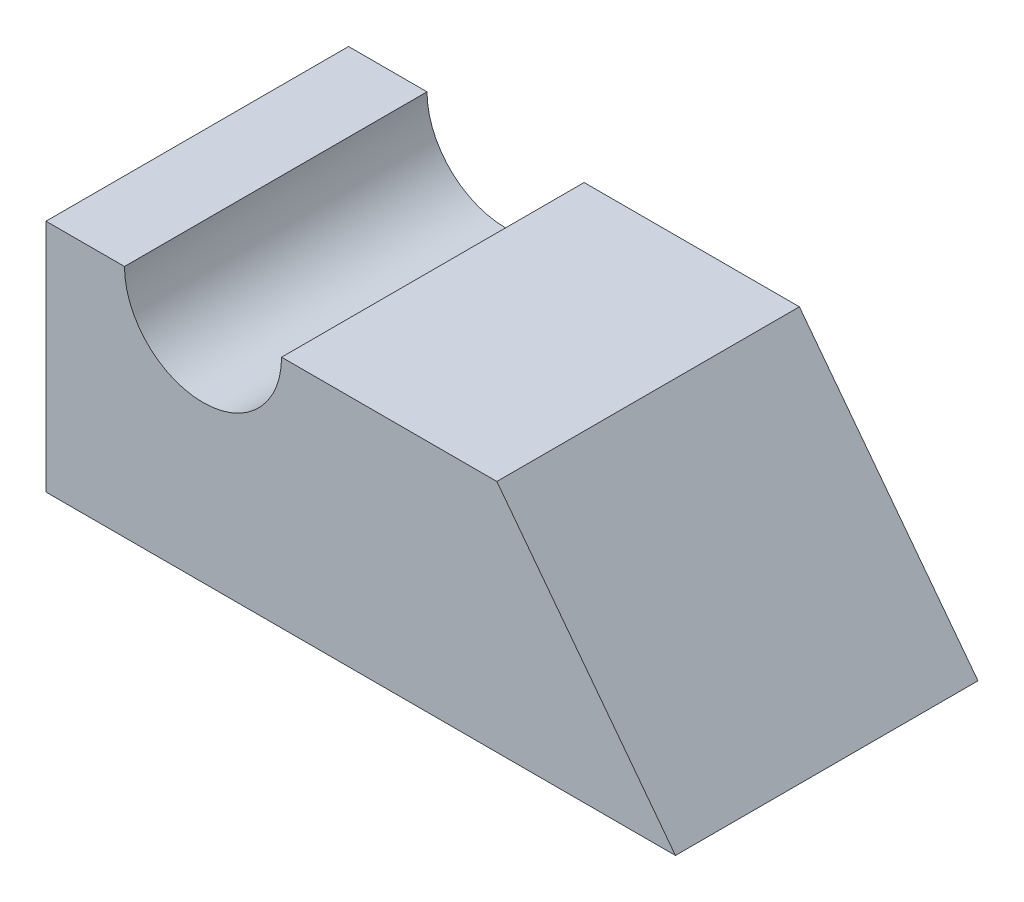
ISO-10303-21;
HEADER;
FILE_DESCRIPTION(('STEP AP214'),'2;1');
FILE_NAME('part.step','',(''),(''),'','','');
FILE_SCHEMA(('AUTOMOTIVE_DESIGN { 1 0 10303 214 1 1 1 1 }'));
ENDSEC;
DATA;
#1=APPLICATION_CONTEXT('core data for automotive mechanical design processes');
#2=APPLICATION_PROTOCOL_DEFINITION('international standard','automotive_design',2000,#1);
#3=PRODUCT_CONTEXT('',#1,'mechanical');
#4=PRODUCT('Part','Part','',(#3));
#5=PRODUCT_RELATED_PRODUCT_CATEGORY('part','',(#4));
#6=PRODUCT_DEFINITION_FORMATION('','',#4);
#7=PRODUCT_DEFINITION_CONTEXT('part definition',#1,'design');
#8=PRODUCT_DEFINITION('design','',#6,#7);
#9=PRODUCT_DEFINITION_SHAPE('','',#8);
#10=(LENGTH_UNIT() NAMED_UNIT(*) SI_UNIT(.MILLI.,.METRE.));
#11=(NAMED_UNIT(*) PLANE_ANGLE_UNIT() SI_UNIT($,.RADIAN.));
#12=(NAMED_UNIT(*) SI_UNIT($,.STERADIAN.) SOLID_ANGLE_UNIT());
#13=UNCERTAINTY_MEASURE_WITH_UNIT(LENGTH_MEASURE(1.E-05),#10,'distance_accuracy_value','');
#14=(GEOMETRIC_REPRESENTATION_CONTEXT(3) GLOBAL_UNCERTAINTY_ASSIGNED_CONTEXT((#13)) GLOBAL_UNIT_ASSIGNED_CONTEXT((#10,
#11,#12)) REPRESENTATION_CONTEXT('',''));
#15=CARTESIAN_POINT('',(0.,0.,0.));
#16=DIRECTION('',(0.,0.,1.));
#17=DIRECTION('',(1.,0.,0.));
#18=AXIS2_PLACEMENT_3D('',#15,#16,#17);
#19=CARTESIAN_POINT('',(0.,35.4548164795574,22.86));
#20=DIRECTION('',(1.,0.,0.));
#21=DIRECTION('',(0.,0.,-1.));
#22=AXIS2_PLACEMENT_3D('',#19,#20,#21);
#23=PLANE('',#22);
#24=DIRECTION('',(0.,-1.,0.));
#25=VECTOR('',#24,1.);
#26=CARTESIAN_POINT('',(0.,35.4548164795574,-22.86));
#27=LINE('',#26,#25);
#28=CARTESIAN_POINT('',(0.,35.4548164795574,-22.86));
#29=VERTEX_POINT('',#28);
#30=CARTESIAN_POINT('',(0.,0.,-22.86));
#31=VERTEX_POINT('',#30);
#32=EDGE_CURVE('E117',#29,#31,#27,.T.);
#33=ORIENTED_EDGE('',*,*,#32,.T.);
#34=DIRECTION('',(0.,0.,-1.));
#35=VECTOR('',#34,1.);
#36=CARTESIAN_POINT('',(0.,0.,22.86));
#37=LINE('',#36,#35);
#38=CARTESIAN_POINT('',(0.,0.,22.86));
#39=VERTEX_POINT('',#38);
#40=EDGE_CURVE('E11',#39,#31,#37,.T.);
#41=ORIENTED_EDGE('',*,*,#40,.F.);
#42=DIRECTION('',(0.,-1.,0.));
#43=VECTOR('',#42,1.);
#44=CARTESIAN_POINT('',(0.,35.4548164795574,22.86));
#45=LINE('',#44,#43);
#46=CARTESIAN_POINT('',(0.,35.4548164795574,22.86));
#47=VERTEX_POINT('',#46);
#48=EDGE_CURVE('E127',#47,#39,#45,.T.);
#49=ORIENTED_EDGE('',*,*,#48,.F.);
#50=DIRECTION('',(0.,0.,-1.));
#51=VECTOR('',#50,1.);
#52=CARTESIAN_POINT('',(0.,35.4548164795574,22.86));
#53=LINE('',#52,#51);
#54=EDGE_CURVE('E113',#47,#29,#53,.T.);
#55=ORIENTED_EDGE('',*,*,#54,.T.);
#56=EDGE_LOOP('',(#33,#41,#49,#55));
#57=FACE_BOUND('',#56,.T.);
#58=ADVANCED_FACE('F33',(#57),#23,.F.);
#59=CARTESIAN_POINT('',(0.,0.,22.86));
#60=DIRECTION('',(0.,1.,0.));
#61=DIRECTION('',(0.,0.,1.));
#62=AXIS2_PLACEMENT_3D('',#59,#60,#61);
#63=PLANE('',#62);
#64=DIRECTION('',(1.,0.,0.));
#65=VECTOR('',#64,1.);
#66=CARTESIAN_POINT('',(0.,0.,-22.86));
#67=LINE('',#66,#65);
#68=CARTESIAN_POINT('',(95.1234671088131,0.,-22.86));
#69=VERTEX_POINT('',#68);
#70=EDGE_CURVE('E120',#31,#69,#67,.T.);
#71=ORIENTED_EDGE('',*,*,#70,.T.);
#72=DIRECTION('',(0.,0.,-1.));
#73=VECTOR('',#72,1.);
#74=CARTESIAN_POINT('',(95.1234671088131,0.,22.86));
#75=LINE('',#74,#73);
#76=CARTESIAN_POINT('',(95.1234671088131,0.,22.86));
#77=VERTEX_POINT('',#76);
#78=EDGE_CURVE('E41',#77,#69,#75,.T.);
#79=ORIENTED_EDGE('',*,*,#78,.F.);
#80=DIRECTION('',(1.,0.,0.));
#81=VECTOR('',#80,1.);
#82=CARTESIAN_POINT('',(0.,0.,22.86));
#83=LINE('',#82,#81);
#84=EDGE_CURVE('E86',#39,#77,#83,.T.);
#85=ORIENTED_EDGE('',*,*,#84,.F.);
#86=ORIENTED_EDGE('',*,*,#40,.T.);
#87=EDGE_LOOP('',(#71,#79,#85,#86));
#88=FACE_BOUND('',#87,.T.);
#89=ADVANCED_FACE('F151',(#88),#63,.F.);
#90=CARTESIAN_POINT('',(95.1234671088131,0.,22.86));
#91=DIRECTION('',(-0.795658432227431,-0.605745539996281,0.));
#92=DIRECTION('',(0.605745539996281,-0.795658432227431,0.));
#93=AXIS2_PLACEMENT_3D('',#90,#91,#92);
#94=PLANE('',#93);
#95=DIRECTION('',(-0.605745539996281,0.795658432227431,0.));
#96=VECTOR('',#95,1.);
#97=CARTESIAN_POINT('',(95.1234671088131,0.,-22.86));
#98=LINE('',#97,#96);
#99=CARTESIAN_POINT('',(68.1312351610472,35.4548164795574,-22.86));
#100=VERTEX_POINT('',#99);
#101=EDGE_CURVE('E122',#69,#100,#98,.T.);
#102=ORIENTED_EDGE('',*,*,#101,.T.);
#103=DIRECTION('',(0.,0.,-1.));
#104=VECTOR('',#103,1.);
#105=CARTESIAN_POINT('',(68.1312351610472,35.4548164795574,22.86));
#106=LINE('',#105,#104);
#107=CARTESIAN_POINT('',(68.1312351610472,35.4548164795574,22.86));
#108=VERTEX_POINT('',#107);
#109=EDGE_CURVE('E108',#108,#100,#106,.T.);
#110=ORIENTED_EDGE('',*,*,#109,.F.);
#111=DIRECTION('',(-0.605745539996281,0.795658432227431,0.));
#112=VECTOR('',#111,1.);
#113=CARTESIAN_POINT('',(95.1234671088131,0.,22.86));
#114=LINE('',#113,#112);
#115=EDGE_CURVE('E99',#77,#108,#114,.T.);
#116=ORIENTED_EDGE('',*,*,#115,.F.);
#117=ORIENTED_EDGE('',*,*,#78,.T.);
#118=EDGE_LOOP('',(#102,#110,#116,#117));
#119=FACE_BOUND('',#118,.T.);
#120=ADVANCED_FACE('F133',(#119),#94,.F.);
#121=CARTESIAN_POINT('',(68.1312351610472,35.4548164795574,22.86));
#122=DIRECTION('',(0.,-1.,0.));
#123=DIRECTION('',(1.,0.,0.));
#124=AXIS2_PLACEMENT_3D('',#121,#122,#123);
#125=PLANE('',#124);
#126=DIRECTION('',(-1.,0.,0.));
#127=VECTOR('',#126,1.);
#128=CARTESIAN_POINT('',(68.1312351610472,35.4548164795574,-22.86));
#129=LINE('',#128,#127);
#130=CARTESIAN_POINT('',(35.5995632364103,35.4548164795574,-22.86));
#131=VERTEX_POINT('',#130);
#132=EDGE_CURVE('E107',#100,#131,#129,.T.);
#133=ORIENTED_EDGE('',*,*,#132,.T.);
#134=DIRECTION('',(0.,0.,-1.));
#135=VECTOR('',#134,1.);
#136=CARTESIAN_POINT('',(35.5995632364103,35.4548164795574,22.86));
#137=LINE('',#136,#135);
#138=CARTESIAN_POINT('',(35.5995632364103,35.4548164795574,22.86));
#139=VERTEX_POINT('',#138);
#140=EDGE_CURVE('E104',#139,#131,#137,.T.);
#141=ORIENTED_EDGE('',*,*,#140,.F.);
#142=DIRECTION('',(-1.,0.,0.));
#143=VECTOR('',#142,1.);
#144=CARTESIAN_POINT('',(68.1312351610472,35.4548164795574,22.86));
#145=LINE('',#144,#143);
#146=EDGE_CURVE('E93',#108,#139,#145,.T.);
#147=ORIENTED_EDGE('',*,*,#146,.F.);
#148=ORIENTED_EDGE('',*,*,#109,.T.);
#149=EDGE_LOOP('',(#133,#141,#147,#148));
#150=FACE_BOUND('',#149,.T.);
#151=ADVANCED_FACE('F105',(#150),#125,.F.);
#152=CARTESIAN_POINT('',(23.7291893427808,35.4548164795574,22.86));
#153=DIRECTION('',(0.,0.,-1.));
#154=DIRECTION('',(-1.,0.,0.));
#155=AXIS2_PLACEMENT_3D('',#152,#153,#154);
#156=CYLINDRICAL_SURFACE('',#155,11.8703738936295);
#157=CARTESIAN_POINT('',(23.7291893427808,35.4548164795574,-22.86));
#158=DIRECTION('',(0.,0.,-1.));
#159=DIRECTION('',(-1.,0.,0.));
#160=AXIS2_PLACEMENT_3D('',#157,#158,#159);
#161=CIRCLE('',#160,11.8703738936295);
#162=CARTESIAN_POINT('',(11.8588154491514,35.4548164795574,-22.86));
#163=VERTEX_POINT('',#162);
#164=EDGE_CURVE('E72',#131,#163,#161,.T.);
#165=ORIENTED_EDGE('',*,*,#164,.T.);
#166=DIRECTION('',(0.,0.,-1.));
#167=VECTOR('',#166,1.);
#168=CARTESIAN_POINT('',(11.8588154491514,35.4548164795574,22.86));
#169=LINE('',#168,#167);
#170=CARTESIAN_POINT('',(11.8588154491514,35.4548164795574,22.86));
#171=VERTEX_POINT('',#170);
#172=EDGE_CURVE('E109',#171,#163,#169,.T.);
#173=ORIENTED_EDGE('',*,*,#172,.F.);
#174=CARTESIAN_POINT('',(23.7291893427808,35.4548164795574,22.86));
#175=DIRECTION('',(0.,0.,-1.));
#176=DIRECTION('',(-1.,0.,0.));
#177=AXIS2_PLACEMENT_3D('',#174,#175,#176);
#178=CIRCLE('',#177,11.8703738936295);
#179=EDGE_CURVE('E97',#139,#171,#178,.T.);
#180=ORIENTED_EDGE('',*,*,#179,.F.);
#181=ORIENTED_EDGE('',*,*,#140,.T.);
#182=EDGE_LOOP('',(#165,#173,#180,#181));
#183=FACE_BOUND('',#182,.T.);
#184=ADVANCED_FACE('F111',(#183),#156,.F.);
#185=CARTESIAN_POINT('',(11.8588154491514,35.4548164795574,22.86));
#186=DIRECTION('',(0.,-1.,0.));
#187=DIRECTION('',(1.,0.,0.));
#188=AXIS2_PLACEMENT_3D('',#185,#186,#187);
#189=PLANE('',#188);
#190=DIRECTION('',(-1.,0.,0.));
#191=VECTOR('',#190,1.);
#192=CARTESIAN_POINT('',(11.8588154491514,35.4548164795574,-22.86));
#193=LINE('',#192,#191);
#194=EDGE_CURVE('E78',#163,#29,#193,.T.);
#195=ORIENTED_EDGE('',*,*,#194,.T.);
#196=ORIENTED_EDGE('',*,*,#54,.F.);
#197=DIRECTION('',(-1.,0.,0.));
#198=VECTOR('',#197,1.);
#199=CARTESIAN_POINT('',(11.8588154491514,35.4548164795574,22.86));
#200=LINE('',#199,#198);
#201=EDGE_CURVE('E49',#171,#47,#200,.T.);
#202=ORIENTED_EDGE('',*,*,#201,.F.);
#203=ORIENTED_EDGE('',*,*,#172,.T.);
#204=EDGE_LOOP('',(#195,#196,#202,#203));
#205=FACE_BOUND('',#204,.T.);
#206=ADVANCED_FACE('F140',(#205),#189,.F.);
#207=CARTESIAN_POINT('',(23.7291893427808,35.4548164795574,22.86));
#208=DIRECTION('',(0.,0.,-1.));
#209=DIRECTION('',(-1.,0.,0.));
#210=AXIS2_PLACEMENT_3D('',#207,#208,#209);
#211=PLANE('',#210);
#212=ORIENTED_EDGE('',*,*,#48,.T.);
#213=ORIENTED_EDGE('',*,*,#84,.T.);
#214=ORIENTED_EDGE('',*,*,#115,.T.);
#215=ORIENTED_EDGE('',*,*,#146,.T.);
#216=ORIENTED_EDGE('',*,*,#179,.T.);
#217=ORIENTED_EDGE('',*,*,#201,.T.);
#218=EDGE_LOOP('',(#212,#213,#214,#215,#216,#217));
#219=FACE_BOUND('',#218,.T.);
#220=ADVANCED_FACE('F95',(#219),#211,.F.);
#221=CARTESIAN_POINT('',(23.7291893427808,35.4548164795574,-22.86));
#222=DIRECTION('',(0.,0.,-1.));
#223=DIRECTION('',(-1.,0.,0.));
#224=AXIS2_PLACEMENT_3D('',#221,#222,#223);
#225=PLANE('',#224);
#226=ORIENTED_EDGE('',*,*,#32,.F.);
#227=ORIENTED_EDGE('',*,*,#194,.F.);
#228=ORIENTED_EDGE('',*,*,#164,.F.);
#229=ORIENTED_EDGE('',*,*,#132,.F.);
#230=ORIENTED_EDGE('',*,*,#101,.F.);
#231=ORIENTED_EDGE('',*,*,#70,.F.);
#232=EDGE_LOOP('',(#226,#227,#228,#229,#230,#231));
#233=FACE_BOUND('',#232,.T.);
#234=ADVANCED_FACE('F136',(#233),#225,.T.);
#235=CLOSED_SHELL('',(#58,#89,#120,#151,#184,#206,#220,#234));
#236=MANIFOLD_SOLID_BREP('B2',#235);
#237=ADVANCED_BREP_SHAPE_REPRESENTATION('',(#18,#236),#14);
#238=SHAPE_DEFINITION_REPRESENTATION(#9,#237);
ENDSEC;
END-ISO-10303-21;
